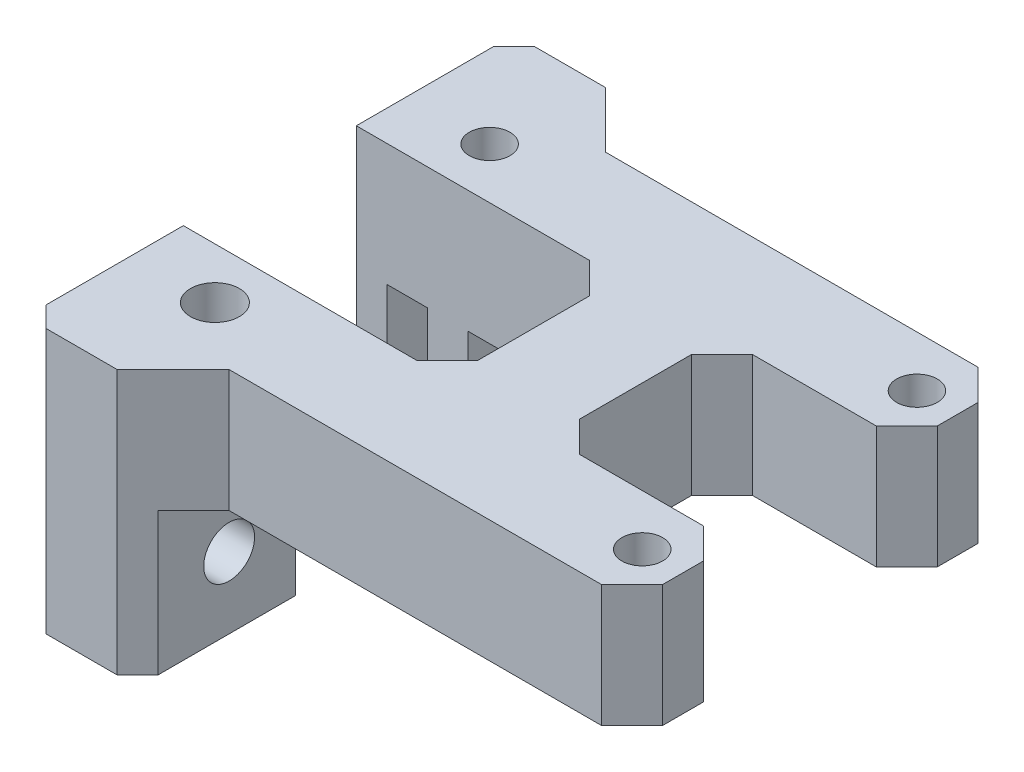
from build123d import *

# Parameters (mm, degrees)
SKETCH1_R           = 1
BOSS_EXTRUDE4_DEPTH = 6
BOSS_EXTRUDE5_DEPTH = 7
BOSS_EXTRUDE6_DEPTH = 6
SKETCH13_R          = 1.25
CUT_EXTRUDE6_DEPTH  = 2
SKETCH14_R          = 0.75
CUT_EXTRUDE7_DEPTH  = 2
SKETCH15_R          = 1
SKETCH15_R_2        = 1.2
CUT_EXTRUDE8_DEPTH  = 6


with BuildPart() as part:
    # Sketch1 → Boss-Extrude4 (new body)
    with BuildSketch(Plane(origin=(0, 0, 0), x_dir=(1, 0, 0), z_dir=(0, 1, 0))):
        Polygon((-10.08, 4.25), (-4, 4.25), (-2.5, 2.75), (-2.5, -2.75), (-4, -4.25), (-10.08, -4.25), (-11.58, -5.75), (-11.58, -7.75), (-10.08, -9.25), (10.08, -9.25), (11.58, -7.75), (11.58, -5.75), (10.08, -4.25), (4, -4.25), (2.5, -2.75), (2.5, 2.75), (4, 4.25), (10.08, 4.25), (11.58, 5.75), (11.58, 7.75), (10.08, 9.25), (-10.08, 9.25), (-11.58, 7.75), (-11.58, 5.75), align=None)
        with Locations(Location((9.58, 6.75, 0), (0, 0, 270))):
            Circle(SKETCH1_R, mode=Mode.SUBTRACT)
        with Locations(Location((9.58, -6.75, 0), (0, 0, 270))):
            Circle(SKETCH1_R, mode=Mode.SUBTRACT)
    extrude(amount=BOSS_EXTRUDE4_DEPTH)

    # Sketch11 → Boss-Extrude5 (add)
    with BuildSketch(Plane.XZ):
        Polygon((-9.97, 4.25), (-11.97, 4.25), (-11.97, 10), (-13.97, 10), (-13.97, 4.25), (-15.47, 4.25), (-15.47, 11), (-14.47, 12), (-10.97, 12), (-9.97, 11), align=None)
        Polygon((-9.97, -4.25), (-11.97, -4.25), (-11.97, -10), (-13.97, -10), (-13.97, -4.25), (-15.47, -4.25), (-15.47, -11), (-14.47, -12), (-10.97, -12), (-9.97, -11), align=None)
    extrude(amount=BOSS_EXTRUDE5_DEPTH)

    # Sketch12 → Boss-Extrude6 (add)
    with BuildSketch(Plane(origin=(0, 0, 0), x_dir=(1, 0, 0), z_dir=(0, 1, 0))):
        Polygon((-10.08, 4.25), (-15.47, 4.25), (-15.47, 11), (-14.47, 12), (-10.97, 12), (-8.22, 9.25), (-10.08, 9.25), (-11.58, 7.75), (-11.58, 5.75), align=None)
        Polygon((-15.47, -4.25), (-15.47, -11), (-14.47, -12), (-10.97, -12), (-8.22, -9.25), (-10.08, -9.25), (-11.58, -7.75), (-11.58, -5.75), (-10.08, -4.25), align=None)
    extrude(amount=BOSS_EXTRUDE6_DEPTH)

    # Sketch13 → Cut-Extrude6 (cut)
    with BuildSketch(Plane(origin=(-9.97, 0, 0), x_dir=(0, 0, -1), z_dir=(1, 0, 0))):
        with Locations((-7.5, -3.5)):
            Circle(SKETCH13_R)
        with Locations((7.5, -3.5)):
            Circle(SKETCH13_R)
    extrude(amount=-CUT_EXTRUDE6_DEPTH, mode=Mode.SUBTRACT)

    # Sketch14 → Cut-Extrude7 (cut)
    with BuildSketch(Plane(origin=(-13.97, 0, 0), x_dir=(0, 0, -1), z_dir=(1, 0, 0))):
        with Locations((-7.5, -3.5)):
            Circle(SKETCH14_R)
        with Locations((7.5, -3.5)):
            Circle(SKETCH14_R)
    extrude(amount=-CUT_EXTRUDE7_DEPTH, mode=Mode.SUBTRACT)

    # Sketch15 → Cut-Extrude8 (cut)
    with BuildSketch(Plane(origin=(0, 6, 0), x_dir=(1, 0, 0), z_dir=(0, 1, 0))):
        with Locations(Location((-11.42, 6.75, 0), (0, 0, 270))):
            Circle(SKETCH15_R)
        with Locations(Location((-11.42, -6.75, 0), (0, 0, 270))):
            Circle(SKETCH15_R_2)
    extrude(amount=-CUT_EXTRUDE8_DEPTH, mode=Mode.SUBTRACT)


solid = part.part
